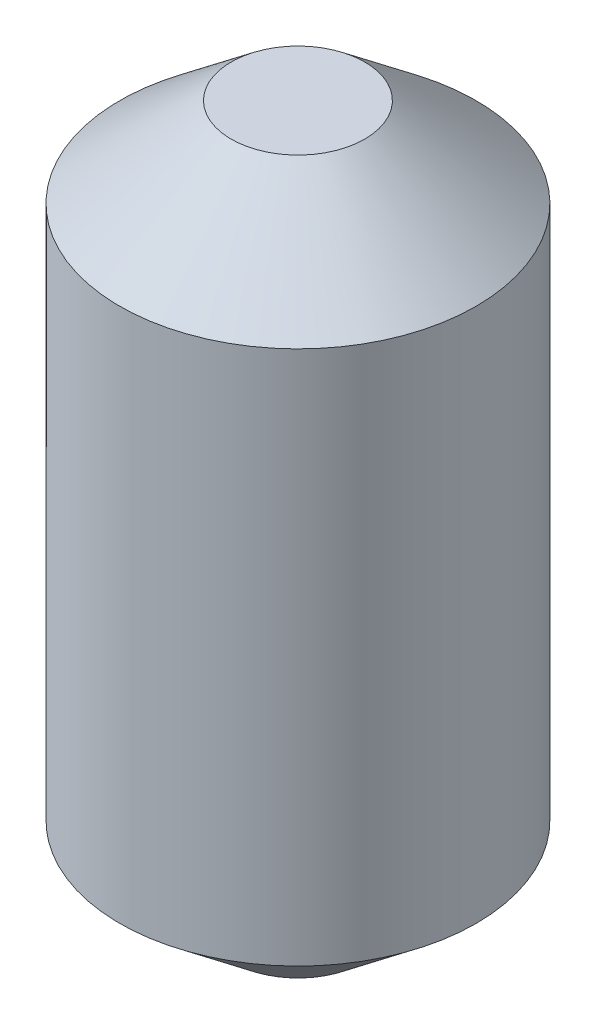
from build123d import *

# Parameters (mm, degrees)
REVOLVE1_ANGLE = 359.99999999


with BuildPart() as part:
    # Sketch1 → Revolve1 (revolve)
    with BuildSketch(Plane.XY):
        Polygon((0, -16000), (3000, -16000), (8000, -12000), (8000, 12000), (3000, 16000), (0, 16000), align=None)
    revolve(axis=Axis((0, -16000, 0), (0, 1, 0)), revolution_arc=REVOLVE1_ANGLE)


solid = part.part
